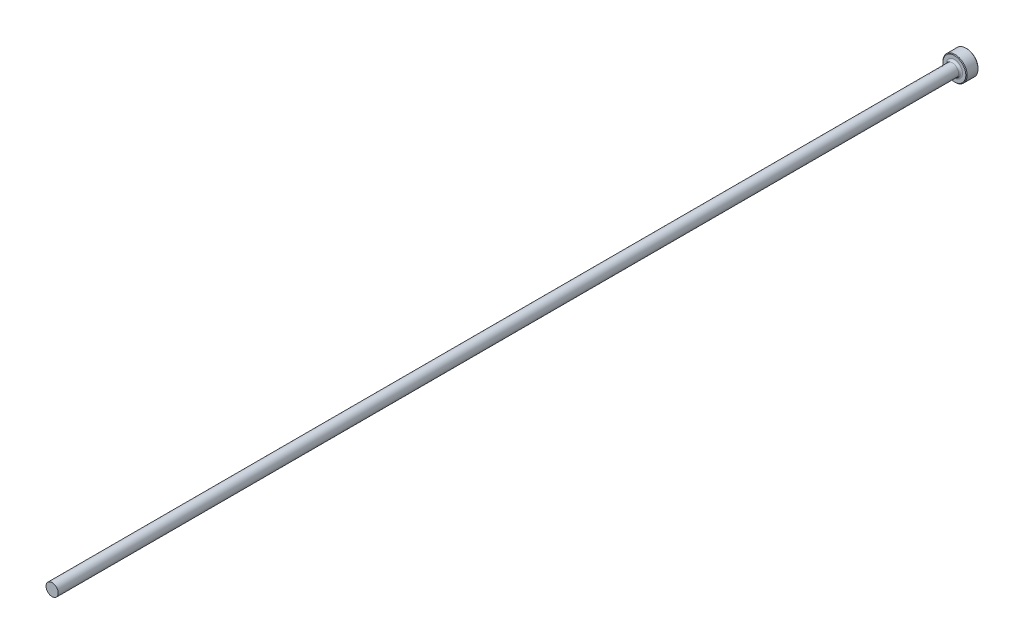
ISO-10303-21;
HEADER;
FILE_DESCRIPTION(('STEP AP214'),'2;1');
FILE_NAME('part.step','',(''),(''),'','','');
FILE_SCHEMA(('AUTOMOTIVE_DESIGN { 1 0 10303 214 1 1 1 1 }'));
ENDSEC;
DATA;
#1=APPLICATION_CONTEXT('core data for automotive mechanical design processes');
#2=APPLICATION_PROTOCOL_DEFINITION('international standard','automotive_design',2000,#1);
#3=PRODUCT_CONTEXT('',#1,'mechanical');
#4=PRODUCT('Part','Part','',(#3));
#5=PRODUCT_RELATED_PRODUCT_CATEGORY('part','',(#4));
#6=PRODUCT_DEFINITION_FORMATION('','',#4);
#7=PRODUCT_DEFINITION_CONTEXT('part definition',#1,'design');
#8=PRODUCT_DEFINITION('design','',#6,#7);
#9=PRODUCT_DEFINITION_SHAPE('','',#8);
#10=(LENGTH_UNIT() NAMED_UNIT(*) SI_UNIT(.MILLI.,.METRE.));
#11=(NAMED_UNIT(*) PLANE_ANGLE_UNIT() SI_UNIT($,.RADIAN.));
#12=(NAMED_UNIT(*) SI_UNIT($,.STERADIAN.) SOLID_ANGLE_UNIT());
#13=UNCERTAINTY_MEASURE_WITH_UNIT(LENGTH_MEASURE(1.E-05),#10,'distance_accuracy_value','');
#14=(GEOMETRIC_REPRESENTATION_CONTEXT(3) GLOBAL_UNCERTAINTY_ASSIGNED_CONTEXT((#13)) GLOBAL_UNIT_ASSIGNED_CONTEXT((#10,
#11,#12)) REPRESENTATION_CONTEXT('',''));
#15=CARTESIAN_POINT('',(0.,0.,0.));
#16=DIRECTION('',(0.,0.,1.));
#17=DIRECTION('',(1.,0.,0.));
#18=AXIS2_PLACEMENT_3D('',#15,#16,#17);
#19=CARTESIAN_POINT('',(0.,2.38124999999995,355.6));
#20=DIRECTION('',(0.,0.,1.));
#21=DIRECTION('',(1.,0.,0.));
#22=AXIS2_PLACEMENT_3D('',#19,#20,#21);
#23=PLANE('',#22);
#24=CARTESIAN_POINT('',(0.,0.,355.6));
#25=DIRECTION('',(0.,0.,-1.));
#26=DIRECTION('',(-1.,0.,0.));
#27=AXIS2_PLACEMENT_3D('',#24,#25,#26);
#28=CIRCLE('',#27,2.38124999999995);
#29=CARTESIAN_POINT('',(-2.38124999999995,0.,355.6));
#30=VERTEX_POINT('',#29);
#31=EDGE_CURVE('E50',#30,#30,#28,.T.);
#32=ORIENTED_EDGE('',*,*,#31,.F.);
#33=EDGE_LOOP('',(#32));
#34=FACE_BOUND('',#33,.T.);
#35=ADVANCED_FACE('F30',(#34),#23,.T.);
#36=CARTESIAN_POINT('',(0.,0.,-25.4347445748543));
#37=DIRECTION('',(0.,0.,-1.));
#38=DIRECTION('',(-1.,0.,0.));
#39=AXIS2_PLACEMENT_3D('',#36,#37,#38);
#40=CYLINDRICAL_SURFACE('',#39,2.38124999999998);
#41=ORIENTED_EDGE('',*,*,#31,.T.);
#42=EDGE_LOOP('',(#41));
#43=FACE_BOUND('',#42,.T.);
#44=CARTESIAN_POINT('',(0.,0.,5.5118));
#45=DIRECTION('',(0.,0.,-1.));
#46=DIRECTION('',(-1.,0.,0.));
#47=AXIS2_PLACEMENT_3D('',#44,#45,#46);
#48=CIRCLE('',#47,2.38125);
#49=CARTESIAN_POINT('',(-2.38125,0.,5.5118));
#50=VERTEX_POINT('',#49);
#51=EDGE_CURVE('E53',#50,#50,#48,.T.);
#52=ORIENTED_EDGE('',*,*,#51,.F.);
#53=EDGE_LOOP('',(#52));
#54=FACE_BOUND('',#53,.T.);
#55=ADVANCED_FACE('F64',(#43,#54),#40,.T.);
#56=CARTESIAN_POINT('',(0.,0.,5.5118));
#57=DIRECTION('',(0.,0.,-1.));
#58=DIRECTION('',(-1.,0.,0.));
#59=AXIS2_PLACEMENT_3D('',#56,#57,#58);
#60=TOROIDAL_SURFACE('',#59,3.14325,0.761999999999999);
#61=ORIENTED_EDGE('',*,*,#51,.T.);
#62=EDGE_LOOP('',(#61));
#63=FACE_BOUND('',#62,.T.);
#64=CARTESIAN_POINT('',(0.,0.,4.7498));
#65=DIRECTION('',(0.,0.,-1.));
#66=DIRECTION('',(-1.,0.,0.));
#67=AXIS2_PLACEMENT_3D('',#64,#65,#66);
#68=CIRCLE('',#67,3.14325);
#69=CARTESIAN_POINT('',(-3.14325,0.,4.7498));
#70=VERTEX_POINT('',#69);
#71=EDGE_CURVE('E56',#70,#70,#68,.T.);
#72=ORIENTED_EDGE('',*,*,#71,.F.);
#73=EDGE_LOOP('',(#72));
#74=FACE_BOUND('',#73,.T.);
#75=ADVANCED_FACE('F62',(#63,#74),#60,.F.);
#76=CARTESIAN_POINT('',(0.,4.69899999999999,4.7498));
#77=DIRECTION('',(0.,0.,1.));
#78=DIRECTION('',(1.,0.,0.));
#79=AXIS2_PLACEMENT_3D('',#76,#77,#78);
#80=PLANE('',#79);
#81=CARTESIAN_POINT('',(0.,0.,4.7498));
#82=DIRECTION('',(0.,0.,1.));
#83=DIRECTION('',(1.,0.,0.));
#84=AXIS2_PLACEMENT_3D('',#81,#82,#83);
#85=CIRCLE('',#84,4.44499999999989);
#86=CARTESIAN_POINT('',(4.44499999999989,0.,4.7498));
#87=VERTEX_POINT('',#86);
#88=EDGE_CURVE('E10',#87,#87,#85,.T.);
#89=ORIENTED_EDGE('',*,*,#88,.T.);
#90=EDGE_LOOP('',(#89));
#91=FACE_BOUND('',#90,.T.);
#92=ORIENTED_EDGE('',*,*,#71,.T.);
#93=EDGE_LOOP('',(#92));
#94=FACE_BOUND('',#93,.T.);
#95=ADVANCED_FACE('F60',(#91,#94),#80,.T.);
#96=CARTESIAN_POINT('',(0.,0.,-25.4347445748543));
#97=DIRECTION('',(0.,0.,-1.));
#98=DIRECTION('',(-1.,0.,0.));
#99=AXIS2_PLACEMENT_3D('',#96,#97,#98);
#100=CYLINDRICAL_SURFACE('',#99,4.699);
#101=CARTESIAN_POINT('',(0.,0.,0.253999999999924));
#102=DIRECTION('',(0.,0.,-1.));
#103=DIRECTION('',(-1.,0.,0.));
#104=AXIS2_PLACEMENT_3D('',#101,#102,#103);
#105=CIRCLE('',#104,4.699);
#106=CARTESIAN_POINT('',(-4.699,0.,0.253999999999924));
#107=VERTEX_POINT('',#106);
#108=EDGE_CURVE('E37',#107,#107,#105,.F.);
#109=ORIENTED_EDGE('',*,*,#108,.T.);
#110=EDGE_LOOP('',(#109));
#111=FACE_BOUND('',#110,.T.);
#112=CARTESIAN_POINT('',(0.,0.,4.49579999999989));
#113=DIRECTION('',(0.,0.,1.));
#114=DIRECTION('',(1.,0.,0.));
#115=AXIS2_PLACEMENT_3D('',#112,#113,#114);
#116=CIRCLE('',#115,4.699);
#117=CARTESIAN_POINT('',(4.699,0.,4.49579999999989));
#118=VERTEX_POINT('',#117);
#119=EDGE_CURVE('E41',#118,#118,#116,.F.);
#120=ORIENTED_EDGE('',*,*,#119,.T.);
#121=EDGE_LOOP('',(#120));
#122=FACE_BOUND('',#121,.T.);
#123=ADVANCED_FACE('F71',(#111,#122),#100,.T.);
#124=CARTESIAN_POINT('',(0.,0.,0.));
#125=DIRECTION('',(0.,0.,-1.));
#126=DIRECTION('',(-1.,0.,0.));
#127=AXIS2_PLACEMENT_3D('',#124,#125,#126);
#128=PLANE('',#127);
#129=CARTESIAN_POINT('',(0.,0.,0.));
#130=DIRECTION('',(0.,0.,-1.));
#131=DIRECTION('',(-1.,0.,0.));
#132=AXIS2_PLACEMENT_3D('',#129,#130,#131);
#133=CIRCLE('',#132,4.44500000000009);
#134=CARTESIAN_POINT('',(-4.44500000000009,0.,0.));
#135=VERTEX_POINT('',#134);
#136=EDGE_CURVE('E45',#135,#135,#133,.T.);
#137=ORIENTED_EDGE('',*,*,#136,.T.);
#138=EDGE_LOOP('',(#137));
#139=FACE_BOUND('',#138,.T.);
#140=ADVANCED_FACE('F83',(#139),#128,.T.);
#141=CARTESIAN_POINT('',(0.,0.,0.));
#142=DIRECTION('',(0.,0.,1.));
#143=DIRECTION('',(1.,0.,0.));
#144=AXIS2_PLACEMENT_3D('',#141,#142,#143);
#145=CONICAL_SURFACE('',#144,4.44500000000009,0.785398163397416);
#146=ORIENTED_EDGE('',*,*,#108,.F.);
#147=EDGE_LOOP('',(#146));
#148=FACE_BOUND('',#147,.T.);
#149=ORIENTED_EDGE('',*,*,#136,.F.);
#150=EDGE_LOOP('',(#149));
#151=FACE_BOUND('',#150,.T.);
#152=ADVANCED_FACE('F81',(#148,#151),#145,.T.);
#153=CARTESIAN_POINT('',(0.,0.,4.49579999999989));
#154=DIRECTION('',(0.,0.,-1.));
#155=DIRECTION('',(-1.,0.,0.));
#156=AXIS2_PLACEMENT_3D('',#153,#154,#155);
#157=CONICAL_SURFACE('',#156,4.699,0.78539816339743);
#158=ORIENTED_EDGE('',*,*,#88,.F.);
#159=EDGE_LOOP('',(#158));
#160=FACE_BOUND('',#159,.T.);
#161=ORIENTED_EDGE('',*,*,#119,.F.);
#162=EDGE_LOOP('',(#161));
#163=FACE_BOUND('',#162,.T.);
#164=ADVANCED_FACE('F32',(#160,#163),#157,.T.);
#165=CLOSED_SHELL('',(#35,#55,#75,#95,#123,#140,#152,#164));
#166=MANIFOLD_SOLID_BREP('B2',#165);
#167=ADVANCED_BREP_SHAPE_REPRESENTATION('',(#18,#166),#14);
#168=SHAPE_DEFINITION_REPRESENTATION(#9,#167);
ENDSEC;
END-ISO-10303-21;
